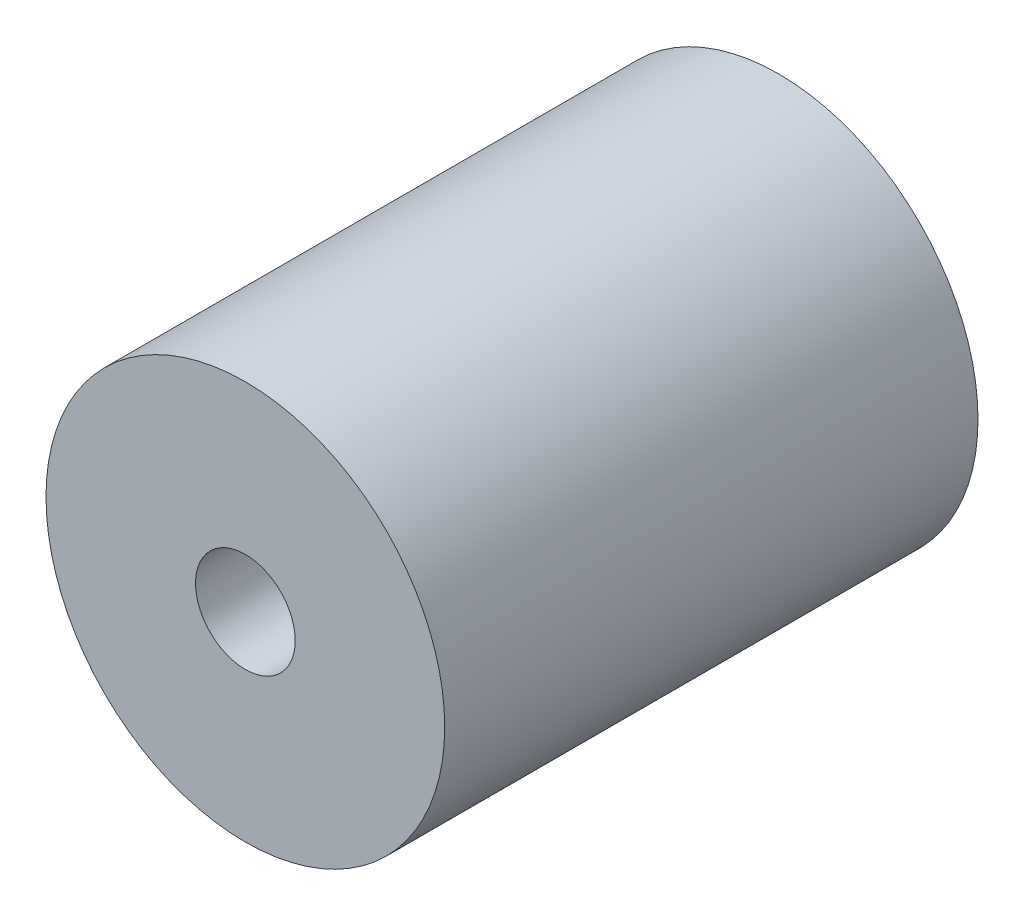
from build123d import *

# Parameters (mm, degrees)
SKETCH1_R           = 4
SKETCH1_R_2         = 1
BOSS_EXTRUDE2_DEPTH = 10.7


with BuildPart() as part:
    # Sketch1 → Boss-Extrude2 (new body)
    with BuildSketch(Plane.XY):
        Circle(SKETCH1_R)
        Circle(SKETCH1_R_2, mode=Mode.SUBTRACT)
    extrude(amount=BOSS_EXTRUDE2_DEPTH)


solid = part.part
